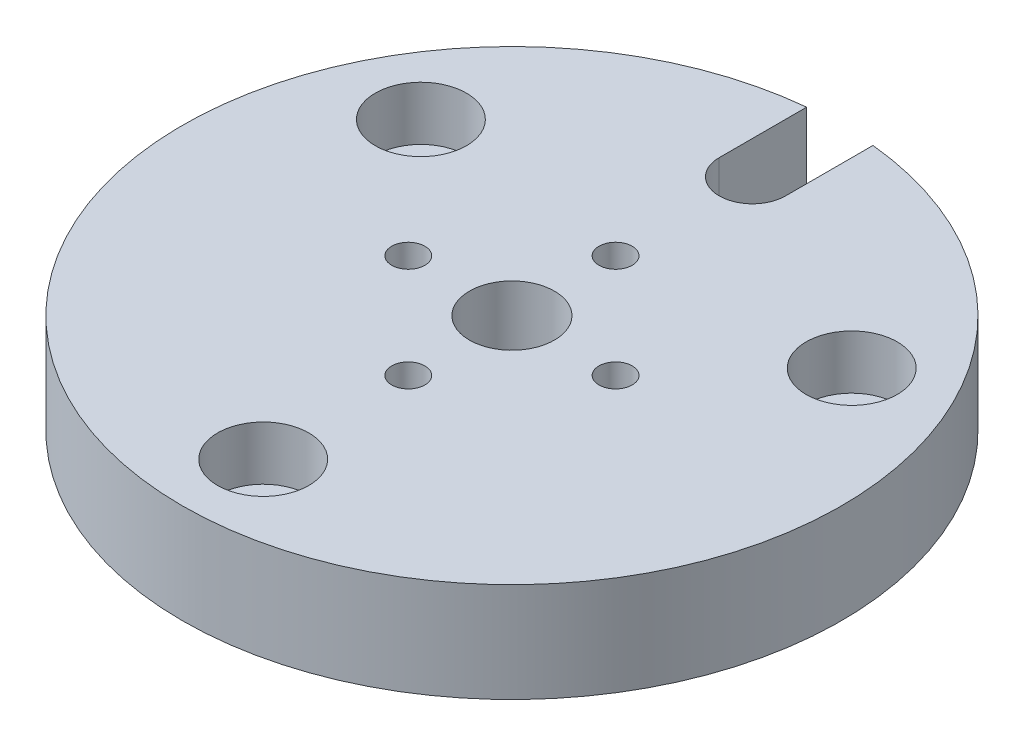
from build123d import *

# Parameters (mm, degrees)
CHAMBRAGE_POUR_VIS_T_TE_HEXAGONALE_M61_D           = 6.5
CHAMBRAGE_POUR_VIS_T_TE_HEXAGONALE_M61_CBORE_D     = 11
CHAMBRAGE_POUR_VIS_T_TE_HEXAGONALE_M61_CBORE_DEPTH = 6.5
ESQUISSE5_R                                        = 2
ENL_V_MAT_EXTRU_1_DEPTH                            = 60.666783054
CHANFREIN1_SIZE                                    = 1
CHANFREIN1_SIZE2                                   = 0.577350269


with BuildPart() as part:
    # Esquisse1 → R_volution1 (revolve)
    with BuildSketch(Plane.XY, mode=Mode.PRIVATE) as r_volution1_sk:
        Polygon((20, 0), (39.75, 0), (39.75, 12), (5.125, 12), (5.125, -8), (20, -8), align=None)
    revolve(r_volution1_sk.sketch.rotate(Axis((0, 26.99198869, 0), (0, -1, 0)), 90), axis=Axis((0, 26.99198869, 0), (0, -1, 0)))

    # Chambrage pour vis _ t_te hexagonale M61 (through all)
    with Locations(Plane(origin=(0, 12, 0), x_dir=(-1, 0, 0), z_dir=(0, 1, 0))):
        with Locations((0, 30), (25.980762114, -15), (-25.980762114, -15)):
            CounterBoreHole(CHAMBRAGE_POUR_VIS_T_TE_HEXAGONALE_M61_D / 2, CHAMBRAGE_POUR_VIS_T_TE_HEXAGONALE_M61_CBORE_D / 2, CHAMBRAGE_POUR_VIS_T_TE_HEXAGONALE_M61_CBORE_DEPTH)

    # Esquisse5 → Enl_v. mat.-Extru.1 (cut, through all)
    with BuildSketch(Plane(origin=(0, 12, 0), x_dir=(-1, 0, 0), z_dir=(0, 1, 0))):
        with Locations(Location((0, -12.5, 0), (0, 0, 90))):
            Circle(ESQUISSE5_R)
        with Locations(Location((0, 12.5, 0), (0, 0, 270))):
            Circle(ESQUISSE5_R)
        with Locations(Location((-12.5, 0, 0), (0, 0, 90))):
            Circle(ESQUISSE5_R)
        with Locations(Location((12.5, 0, 0), (0, 0, 270))):
            Circle(ESQUISSE5_R)
        with BuildLine():
            Line((-4, -39.548230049), (-4, -29))
            ThreePointArc((-4, -29), (0, -25), (4, -29))
            Line((4, -29), (4, -39.548230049))
            ThreePointArc((4, -39.548230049), (0, -39.75), (-4, -39.548230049))
        make_face()
    extrude(amount=-ENL_V_MAT_EXTRU_1_DEPTH, mode=Mode.SUBTRACT)

    # Chanfrein1
    chanfrein1_edges = [part.edges().sort_by_distance(p)[0] for p in [
        (0, -8, -20),
    ]]
    chanfrein1_side = [part.faces().sort_by_distance(p)[0] for p in [
        (0, -4, -20),
    ]]
    chamfer(chanfrein1_edges, length=CHANFREIN1_SIZE, length2=CHANFREIN1_SIZE2, reference=chanfrein1_side[0])


solid = part.part
